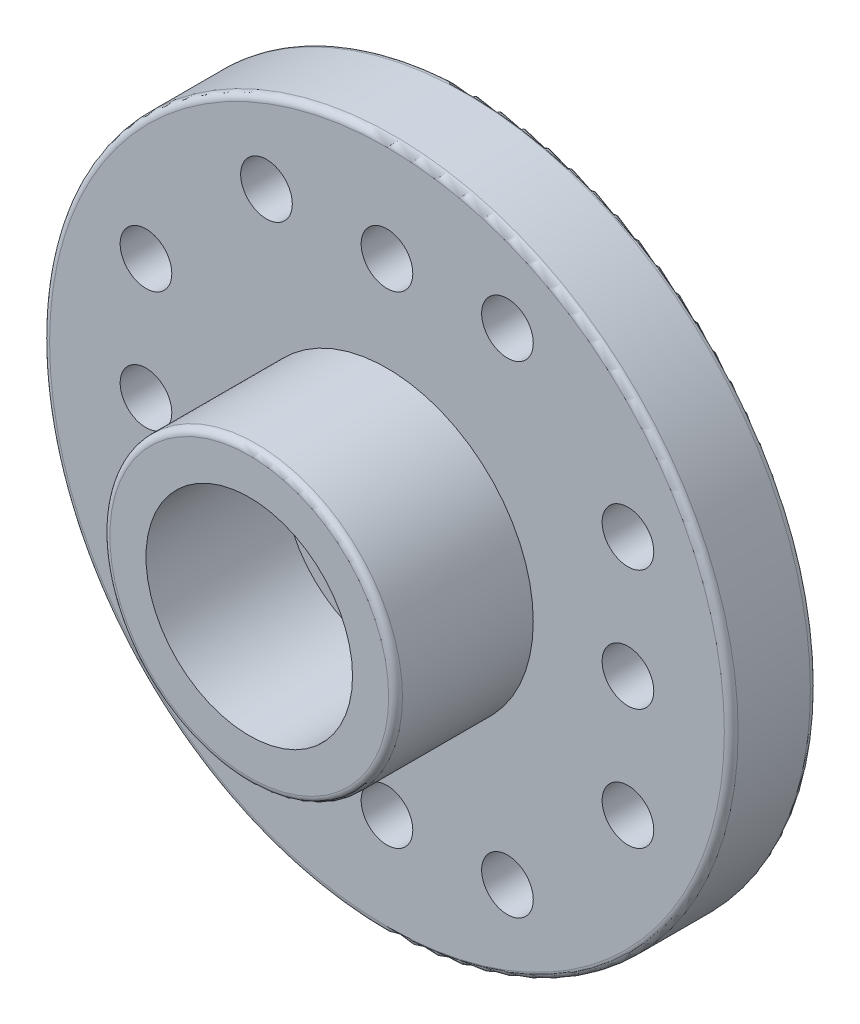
from build123d import *

# Parameters (mm, degrees)
SKETCH1_R           = 10
SKETCH1_R_2         = 0.75
SKETCH1_R_3         = 1.5
BOSS_EXTRUDE1_DEPTH = 2.5
SKETCH5_R           = 4.25
SKETCH5_R_2         = 3
BOSS_EXTRUDE2_DEPTH = 4
SKETCH6_R           = 4.5
CUT_EXTRUDE1_DEPTH  = 0.8
SKETCH7_R           = 3.7
SKETCH7_R_2         = 3.5
BOSS_EXTRUDE3_DEPTH = 1
FILLET1_R           = 0.2


with BuildPart() as part:
    # Sketch1 → Boss-Extrude1 (new body)
    with BuildSketch(Plane.XY):
        Circle(SKETCH1_R)
        with Locations((-7, 0)):
            Circle(SKETCH1_R_2, mode=Mode.SUBTRACT)
        with Locations((3.5, 7)):
            Circle(SKETCH1_R_2, mode=Mode.SUBTRACT)
        with Locations((0, 7)):
            Circle(SKETCH1_R_2, mode=Mode.SUBTRACT)
        with Locations((-3.5, 7)):
            Circle(SKETCH1_R_2, mode=Mode.SUBTRACT)
        with Locations((7, -3.5)):
            Circle(SKETCH1_R_2, mode=Mode.SUBTRACT)
        with Locations((7, 0)):
            Circle(SKETCH1_R_2, mode=Mode.SUBTRACT)
        with Locations((7, 3.5)):
            Circle(SKETCH1_R_2, mode=Mode.SUBTRACT)
        with Locations((-3.5, -7)):
            Circle(SKETCH1_R_2, mode=Mode.SUBTRACT)
        with Locations((0, -7)):
            Circle(SKETCH1_R_2, mode=Mode.SUBTRACT)
        with Locations((3.5, -7)):
            Circle(SKETCH1_R_2, mode=Mode.SUBTRACT)
        with Locations((-7, -3.5)):
            Circle(SKETCH1_R_2, mode=Mode.SUBTRACT)
        with Locations((-7, 3.5)):
            Circle(SKETCH1_R_2, mode=Mode.SUBTRACT)
        Circle(SKETCH1_R_3, mode=Mode.SUBTRACT)
    extrude(amount=BOSS_EXTRUDE1_DEPTH)

    # Sketch5 → Boss-Extrude2 (add)
    with BuildSketch(Plane.XY.offset(2.5)):
        Circle(SKETCH5_R)
        Circle(SKETCH5_R_2, mode=Mode.SUBTRACT)
    extrude(amount=BOSS_EXTRUDE2_DEPTH)

    # Sketch6 → Cut-Extrude1 (cut)
    with BuildSketch(Plane(origin=(0, 0, 0), x_dir=(-1, 0, 0), z_dir=(0, 0, -1))):
        Circle(SKETCH6_R)
    extrude(amount=-CUT_EXTRUDE1_DEPTH, mode=Mode.SUBTRACT)

    # Sketch7 → Boss-Extrude3 (add)
    with BuildSketch(Plane(origin=(0, 0, 0.8), x_dir=(-1, 0, 0), z_dir=(0, 0, -1))):
        with Locations((0.162730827, 0)):
            Circle(SKETCH7_R)
        with Locations((0.162730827, 0)):
            Circle(SKETCH7_R_2, mode=Mode.SUBTRACT)
    extrude(amount=BOSS_EXTRUDE3_DEPTH)

    # Fillet1
    fillet1_edges = [part.edges().sort_by_distance(p)[0] for p in [
        (-10, 0, 0),
        (-10, 0, 2.5),
        (-4.25, 0, 6.5),
        (4.5, 0, 0),
    ]]
    fillet(fillet1_edges, radius=FILLET1_R)


solid = part.part
